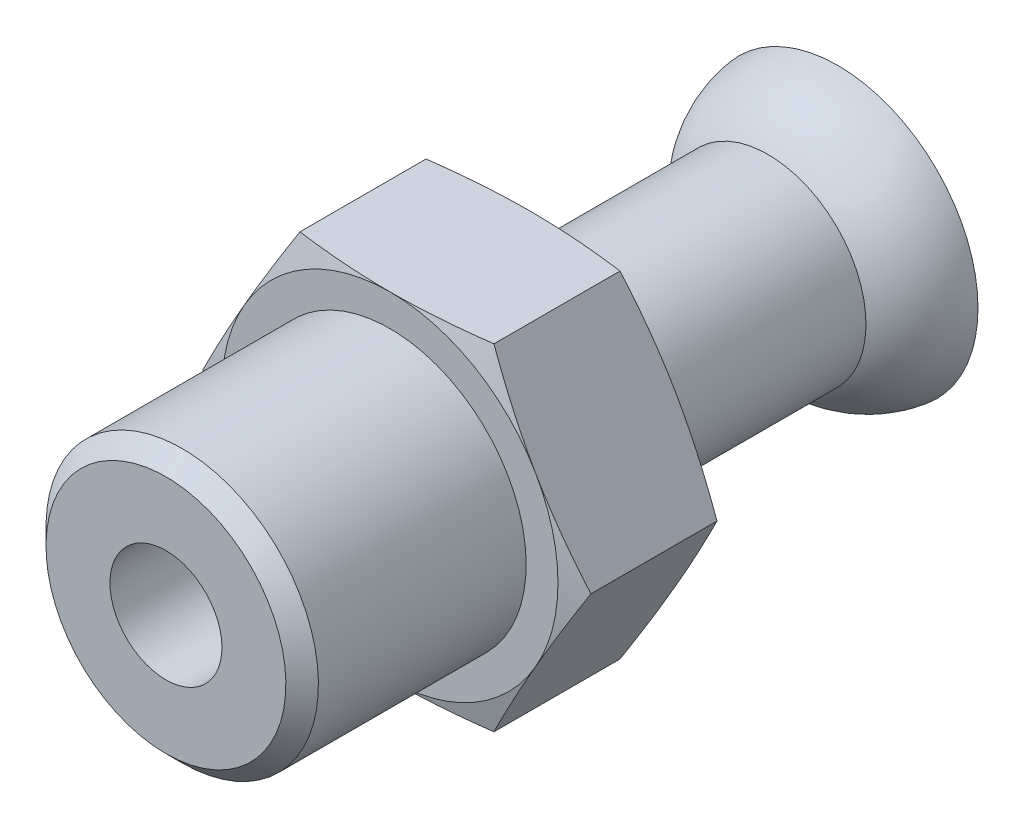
ISO-10303-21;
HEADER;
FILE_DESCRIPTION(('STEP AP214'),'2;1');
FILE_NAME('part.step','',(''),(''),'','','');
FILE_SCHEMA(('AUTOMOTIVE_DESIGN { 1 0 10303 214 1 1 1 1 }'));
ENDSEC;
DATA;
#1=APPLICATION_CONTEXT('core data for automotive mechanical design processes');
#2=APPLICATION_PROTOCOL_DEFINITION('international standard','automotive_design',2000,#1);
#3=PRODUCT_CONTEXT('',#1,'mechanical');
#4=PRODUCT('Part','Part','',(#3));
#5=PRODUCT_RELATED_PRODUCT_CATEGORY('part','',(#4));
#6=PRODUCT_DEFINITION_FORMATION('','',#4);
#7=PRODUCT_DEFINITION_CONTEXT('part definition',#1,'design');
#8=PRODUCT_DEFINITION('design','',#6,#7);
#9=PRODUCT_DEFINITION_SHAPE('','',#8);
#10=(LENGTH_UNIT() NAMED_UNIT(*) SI_UNIT(.MILLI.,.METRE.));
#11=(NAMED_UNIT(*) PLANE_ANGLE_UNIT() SI_UNIT($,.RADIAN.));
#12=(NAMED_UNIT(*) SI_UNIT($,.STERADIAN.) SOLID_ANGLE_UNIT());
#13=UNCERTAINTY_MEASURE_WITH_UNIT(LENGTH_MEASURE(1.E-05),#10,'distance_accuracy_value','');
#14=(GEOMETRIC_REPRESENTATION_CONTEXT(3) GLOBAL_UNCERTAINTY_ASSIGNED_CONTEXT((#13)) GLOBAL_UNIT_ASSIGNED_CONTEXT((#10,
#11,#12)) REPRESENTATION_CONTEXT('',''));
#15=CARTESIAN_POINT('',(0.,0.,0.));
#16=DIRECTION('',(0.,0.,1.));
#17=DIRECTION('',(1.,0.,0.));
#18=AXIS2_PLACEMENT_3D('',#15,#16,#17);
#19=CARTESIAN_POINT('',(6.92820323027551,0.,11.));
#20=DIRECTION('',(0.866025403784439,0.5,0.));
#21=DIRECTION('',(0.,0.,1.));
#22=AXIS2_PLACEMENT_3D('',#19,#20,#21);
#23=PLANE('',#22);
#24=DIRECTION('',(0.,0.,1.));
#25=VECTOR('',#24,1.);
#26=CARTESIAN_POINT('',(3.46410161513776,6.,11.));
#27=LINE('',#26,#25);
#28=CARTESIAN_POINT('',(3.46410161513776,6.,11.2487113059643));
#29=VERTEX_POINT('',#28);
#30=CARTESIAN_POINT('',(3.46410161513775,6.,15.7512886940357));
#31=VERTEX_POINT('',#30);
#32=EDGE_CURVE('E10',#29,#31,#27,.T.);
#33=ORIENTED_EDGE('',*,*,#32,.T.);
#34=CARTESIAN_POINT('',(5.19615242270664,3.00000000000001,16.));
#35=CARTESIAN_POINT('',(5.12404359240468,3.12480967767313,16.0000199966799));
#36=CARTESIAN_POINT('',(5.05188034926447,3.24958799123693,15.9986484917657));
#37=CARTESIAN_POINT('',(4.90798279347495,3.49847134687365,15.9931540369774));
#38=CARTESIAN_POINT('',(4.83624819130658,3.62257653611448,15.9890453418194));
#39=CARTESIAN_POINT('',(4.69263452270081,3.87142043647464,15.9780801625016));
#40=CARTESIAN_POINT('',(4.62075656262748,3.99615917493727,15.9712098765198));
#41=CARTESIAN_POINT('',(4.47601669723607,4.24735284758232,15.9547641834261));
#42=CARTESIAN_POINT('',(4.4031559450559,4.37380590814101,15.9451503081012));
#43=CARTESIAN_POINT('',(4.25929007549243,4.62306506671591,15.9237525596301));
#44=CARTESIAN_POINT('',(4.18828746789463,4.74587821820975,15.9120336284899));
#45=CARTESIAN_POINT('',(4.04576334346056,4.99249350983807,15.8862377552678));
#46=CARTESIAN_POINT('',(3.97424314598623,5.11629421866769,15.872139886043));
#47=CARTESIAN_POINT('',(3.83027325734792,5.36560571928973,15.8416075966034));
#48=CARTESIAN_POINT('',(3.75782595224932,5.49111391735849,15.8251409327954));
#49=CARTESIAN_POINT('',(3.61160134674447,5.74445673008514,15.7898805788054));
#50=CARTESIAN_POINT('',(3.5378266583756,5.87228726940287,15.7710466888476));
#51=CARTESIAN_POINT('',(3.46410161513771,5.99999999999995,15.7512886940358));
#52=B_SPLINE_CURVE_WITH_KNOTS('',3,(#34,#35,#36,#37,#38,#39,#40,#41,#42,#43,#44,#45,#46,#47,#48,
#49,#50,#51),.UNSPECIFIED.,.F.,.F.,(4,2,2,2,2,2,2,2,4),(0.,0.432421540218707,0.862608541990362,
1.29497279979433,1.73372521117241,2.16073850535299,2.59172526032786,3.02925966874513,
3.4756093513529),.UNSPECIFIED.);
#53=CARTESIAN_POINT('',(5.19615242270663,3.,16.));
#54=VERTEX_POINT('',#53);
#55=EDGE_CURVE('E752',#54,#31,#52,.T.);
#56=ORIENTED_EDGE('',*,*,#55,.F.);
#57=CARTESIAN_POINT('',(6.92820323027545,0.,15.7512886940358));
#58=CARTESIAN_POINT('',(6.85446990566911,0.127692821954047,15.7710449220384));
#59=CARTESIAN_POINT('',(6.78066033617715,0.255488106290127,15.7898769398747));
#60=CARTESIAN_POINT('',(6.63438238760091,0.508780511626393,15.825134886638));
#61=CARTESIAN_POINT('',(6.56191621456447,0.634273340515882,15.8416008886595));
#62=CARTESIAN_POINT('',(6.41799291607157,0.883612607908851,15.8721331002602));
#63=CARTESIAN_POINT('',(6.34653685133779,1.00745570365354,15.8862314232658));
#64=CARTESIAN_POINT('',(6.20421306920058,1.25420625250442,15.9120298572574));
#65=CARTESIAN_POINT('',(6.13334596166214,1.3771118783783,15.9237507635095));
#66=CARTESIAN_POINT('',(5.98940836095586,1.62632912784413,15.9451502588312));
#67=CARTESIAN_POINT('',(5.91633055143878,1.75264209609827,15.9547643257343));
#68=CARTESIAN_POINT('',(5.77116669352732,2.0035712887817,15.9712102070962));
#69=CARTESIAN_POINT('',(5.69908163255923,2.1281855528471,15.9780803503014));
#70=CARTESIAN_POINT('',(5.55538561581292,2.37698191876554,15.9890454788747));
#71=CARTESIAN_POINT('',(5.4837740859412,2.50116308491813,15.9931541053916));
#72=CARTESIAN_POINT('',(5.34017760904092,2.75023994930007,15.9986485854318));
#73=CARTESIAN_POINT('',(5.26819267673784,2.87513597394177,16.0000200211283));
#74=CARTESIAN_POINT('',(5.19615242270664,3.00000000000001,16.));
#75=B_SPLINE_CURVE_WITH_KNOTS('',3,(#57,#58,#59,#60,#61,#62,#63,#64,#65,#66,#67,#68,#69,#70,#71,
#72,#73,#74),.UNSPECIFIED.,.F.,.F.,(4,2,2,2,2,2,2,2,4),(0.,0.446310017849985,0.883832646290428,
1.31483340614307,1.74188406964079,2.180598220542,2.61294971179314,3.04314949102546,
3.47560937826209),.UNSPECIFIED.);
#76=CARTESIAN_POINT('',(6.92820323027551,0.,15.7512886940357));
#77=VERTEX_POINT('',#76);
#78=EDGE_CURVE('E816',#77,#54,#75,.T.);
#79=ORIENTED_EDGE('',*,*,#78,.F.);
#80=DIRECTION('',(0.,0.,1.));
#81=VECTOR('',#80,1.);
#82=CARTESIAN_POINT('',(6.92820323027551,0.,11.));
#83=LINE('',#82,#81);
#84=CARTESIAN_POINT('',(6.92820323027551,0.,11.2487113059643));
#85=VERTEX_POINT('',#84);
#86=EDGE_CURVE('E456',#85,#77,#83,.T.);
#87=ORIENTED_EDGE('',*,*,#86,.F.);
#88=CARTESIAN_POINT('',(5.19615242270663,3.,11.));
#89=CARTESIAN_POINT('',(5.26818635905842,2.8751470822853,10.9999800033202));
#90=CARTESIAN_POINT('',(5.34016592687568,2.75026272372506,11.0013515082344));
#91=CARTESIAN_POINT('',(5.48375645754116,2.50120210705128,11.0068459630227));
#92=CARTESIAN_POINT('',(5.55536740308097,2.37702552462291,11.0109546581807));
#93=CARTESIAN_POINT('',(5.6990657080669,2.12823048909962,11.0219198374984));
#94=CARTESIAN_POINT('',(5.77115364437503,2.00361298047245,11.0287901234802));
#95=CARTESIAN_POINT('',(5.91632381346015,1.75266774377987,11.0452358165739));
#96=CARTESIAN_POINT('',(5.98940500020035,1.62634195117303,11.0548496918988));
#97=CARTESIAN_POINT('',(6.13333682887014,1.37712087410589,11.0762474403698));
#98=CARTESIAN_POINT('',(6.20419483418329,1.25422423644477,11.0879663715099));
#99=CARTESIAN_POINT('',(6.34650787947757,1.00748707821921,11.1137622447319));
#100=CARTESIAN_POINT('',(6.4179623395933,0.883648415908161,11.1278601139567));
#101=CARTESIAN_POINT('',(6.56188748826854,0.634311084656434,11.1583924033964));
#102=CARTESIAN_POINT('',(6.63435712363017,0.508815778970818,11.1748590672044));
#103=CARTESIAN_POINT('',(6.78064613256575,0.2555101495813,11.2101194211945));
#104=CARTESIAN_POINT('',(6.85446328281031,0.127704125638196,11.2289533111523));
#105=CARTESIAN_POINT('',(6.92820323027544,0.,11.2487113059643));
#106=B_SPLINE_CURVE_WITH_KNOTS('',3,(#88,#89,#90,#91,#92,#93,#94,#95,#96,#97,#98,#99,#100,#101,
#102,#103,#104,#105),.UNSPECIFIED.,.F.,.F.,(4,2,2,2,2,2,2,2,4),(0.,0.432421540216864,
0.8626085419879,1.29497279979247,1.73372521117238,2.16073850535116,2.59172526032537,
3.02925966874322,3.4756093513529),.UNSPECIFIED.);
#107=CARTESIAN_POINT('',(5.19615242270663,3.,11.));
#108=VERTEX_POINT('',#107);
#109=EDGE_CURVE('E670',#108,#85,#106,.T.);
#110=ORIENTED_EDGE('',*,*,#109,.F.);
#111=CARTESIAN_POINT('',(3.46410161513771,5.99999999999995,11.2487113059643));
#112=CARTESIAN_POINT('',(3.53782018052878,5.8722986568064,11.2289550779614));
#113=CARTESIAN_POINT('',(3.61158935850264,5.74448005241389,11.2101230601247));
#114=CARTESIAN_POINT('',(3.75780804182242,5.49115343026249,11.174865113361));
#115=CARTESIAN_POINT('',(3.83025493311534,5.36564946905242,11.1583991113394));
#116=CARTESIAN_POINT('',(3.97422742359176,5.11633860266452,11.1278668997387));
#117=CARTESIAN_POINT('',(4.04575065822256,4.99253428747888,11.1137685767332));
#118=CARTESIAN_POINT('',(4.1882810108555,4.74590300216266,11.087970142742));
#119=CARTESIAN_POINT('',(4.25928685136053,4.62307747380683,11.0762492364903));
#120=CARTESIAN_POINT('',(4.40314652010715,4.37381523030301,11.0548497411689));
#121=CARTESIAN_POINT('',(4.47599785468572,4.24737150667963,11.0452356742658));
#122=CARTESIAN_POINT('',(4.6207269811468,3.99619132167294,11.0287897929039));
#123=CARTESIAN_POINT('',(4.69260356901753,3.87145669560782,11.0219196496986));
#124=CARTESIAN_POINT('',(4.83621953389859,3.62261411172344,11.0109545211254));
#125=CARTESIAN_POINT('',(4.90795781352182,3.49850612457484,11.0068458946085));
#126=CARTESIAN_POINT('',(5.05186646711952,3.24960949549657,11.0013514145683));
#127=CARTESIAN_POINT('',(5.1240371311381,3.12482070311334,10.9999799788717));
#128=CARTESIAN_POINT('',(5.19615242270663,3.,11.));
#129=B_SPLINE_CURVE_WITH_KNOTS('',3,(#111,#112,#113,#114,#115,#116,#117,#118,#119,#120,#121,
#122,#123,#124,#125,#126,#127,#128),.UNSPECIFIED.,.F.,.F.,(4,2,2,2,2,2,2,2,4),(0.,
0.446310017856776,0.883832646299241,1.31483340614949,1.74188406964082,2.18059822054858,
2.61294971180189,3.04314949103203,3.47560937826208),.UNSPECIFIED.);
#130=EDGE_CURVE('E603',#29,#108,#129,.T.);
#131=ORIENTED_EDGE('',*,*,#130,.F.);
#132=EDGE_LOOP('',(#33,#56,#79,#87,#110,#131));
#133=FACE_BOUND('',#132,.T.);
#134=ADVANCED_FACE('F15',(#133),#23,.T.);
#135=CARTESIAN_POINT('',(3.46410161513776,6.,11.));
#136=DIRECTION('',(0.,1.,0.));
#137=DIRECTION('',(-1.,0.,0.));
#138=AXIS2_PLACEMENT_3D('',#135,#136,#137);
#139=PLANE('',#138);
#140=DIRECTION('',(0.,0.,1.));
#141=VECTOR('',#140,1.);
#142=CARTESIAN_POINT('',(-3.46410161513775,6.,11.));
#143=LINE('',#142,#141);
#144=CARTESIAN_POINT('',(-3.46410161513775,6.,11.2487113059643));
#145=VERTEX_POINT('',#144);
#146=CARTESIAN_POINT('',(-3.46410161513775,6.,15.7512886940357));
#147=VERTEX_POINT('',#146);
#148=EDGE_CURVE('E29',#145,#147,#143,.T.);
#149=ORIENTED_EDGE('',*,*,#148,.T.);
#150=CARTESIAN_POINT('',(0.,6.00000000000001,16.));
#151=CARTESIAN_POINT('',(-0.144124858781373,5.99995669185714,16.0000200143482));
#152=CARTESIAN_POINT('',(-0.288249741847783,5.99985529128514,15.998647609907));
#153=CARTESIAN_POINT('',(-0.575724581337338,5.9996917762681,15.9931504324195));
#154=CARTESIAN_POINT('',(-0.719074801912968,5.99962946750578,15.9890394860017));
#155=CARTESIAN_POINT('',(-1.00641973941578,5.99969625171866,15.9780688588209));
#156=CARTESIAN_POINT('',(-1.15041390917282,5.99982634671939,15.9711949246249));
#157=CARTESIAN_POINT('',(-1.44040510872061,6.00008659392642,15.9547411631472));
#158=CARTESIAN_POINT('',(-1.58639991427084,6.00021671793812,15.9451224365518));
#159=CARTESIAN_POINT('',(-1.87425873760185,6.00025188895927,15.9237187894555));
#160=CARTESIAN_POINT('',(-2.0161276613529,6.00016292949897,15.9119995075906));
#161=CARTESIAN_POINT('',(-2.30096544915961,6.00002759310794,15.8862047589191));
#162=CARTESIAN_POINT('',(-2.44393243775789,5.99998161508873,15.872108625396));
#163=CARTESIAN_POINT('',(-2.73179478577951,5.99993999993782,15.8415817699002));
#164=CARTESIAN_POINT('',(-2.87668673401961,5.99994513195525,15.8251190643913));
#165=CARTESIAN_POINT('',(-3.16913182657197,5.99997062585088,15.7898686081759));
#166=CARTESIAN_POINT('',(-3.3166801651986,5.99999129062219,15.771040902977));
#167=CARTESIAN_POINT('',(-3.46410161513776,6.00000000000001,15.7512886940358));
#168=B_SPLINE_CURVE_WITH_KNOTS('',3,(#150,#151,#152,#153,#154,#155,#156,#157,#158,#159,#160,
#161,#162,#163,#164,#165,#166,#167),.UNSPECIFIED.,.F.,.F.,(4,2,2,2,2,2,2,2,4),(0.,
0.432367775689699,0.86256894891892,1.2950184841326,1.73393012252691,2.16096837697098,
2.59193173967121,3.02939030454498,3.47560819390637),.UNSPECIFIED.);
#169=CARTESIAN_POINT('',(0.,6.,16.));
#170=VERTEX_POINT('',#169);
#171=EDGE_CURVE('E509',#170,#147,#168,.T.);
#172=ORIENTED_EDGE('',*,*,#171,.F.);
#173=CARTESIAN_POINT('',(3.46410161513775,6.00000000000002,15.7512886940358));
#174=CARTESIAN_POINT('',(3.31726869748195,5.99999159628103,15.7709619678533));
#175=CARTESIAN_POINT('',(3.17031004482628,5.99996749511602,15.7897190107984));
#176=CARTESIAN_POINT('',(2.87903739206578,5.99993021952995,15.8248474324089));
#177=CARTESIAN_POINT('',(2.73472816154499,5.9999168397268,15.8412584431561));
#178=CARTESIAN_POINT('',(2.4480336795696,5.99993958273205,15.8717010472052));
#179=CARTESIAN_POINT('',(2.30565182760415,5.99997497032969,15.8857644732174));
#180=CARTESIAN_POINT('',(2.02199764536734,6.00008886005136,15.9115131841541));
#181=CARTESIAN_POINT('',(1.88072720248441,6.00016696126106,15.9232192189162));
#182=CARTESIAN_POINT('',(1.59291852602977,6.00012156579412,15.9447025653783));
#183=CARTESIAN_POINT('',(1.44637393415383,5.99999070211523,15.9543951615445));
#184=CARTESIAN_POINT('',(1.15526705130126,5.99974077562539,15.9709752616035));
#185=CARTESIAN_POINT('',(1.01070698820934,5.99962156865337,15.9779015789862));
#186=CARTESIAN_POINT('',(0.72219940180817,5.99958067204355,15.9889562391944));
#187=CARTESIAN_POINT('',(0.578252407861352,5.99965800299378,15.9930983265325));
#188=CARTESIAN_POINT('',(0.289537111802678,5.99984558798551,15.9986377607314));
#189=CARTESIAN_POINT('',(0.14476852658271,5.9999560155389,16.0000203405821));
#190=CARTESIAN_POINT('',(0.,6.00000000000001,16.));
#191=B_SPLINE_CURVE_WITH_KNOTS('',3,(#173,#174,#175,#176,#177,#178,#179,#180,#181,#182,#183,
#184,#185,#186,#187,#188,#189,#190),.UNSPECIFIED.,.F.,.F.,(4,2,2,2,2,2,2,2,4),(0.,
0.444436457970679,0.880140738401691,1.30934776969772,1.73459368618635,2.17516540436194,
2.60931783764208,3.04131099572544,3.47560975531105),.UNSPECIFIED.);
#192=EDGE_CURVE('E722',#31,#170,#191,.T.);
#193=ORIENTED_EDGE('',*,*,#192,.F.);
#194=ORIENTED_EDGE('',*,*,#32,.F.);
#195=CARTESIAN_POINT('',(0.,6.,11.));
#196=CARTESIAN_POINT('',(0.144124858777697,5.99995669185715,10.9999799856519));
#197=CARTESIAN_POINT('',(0.288249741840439,5.9998552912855,11.001352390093));
#198=CARTESIAN_POINT('',(0.575724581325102,5.99969177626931,11.0068495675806));
#199=CARTESIAN_POINT('',(0.719074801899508,5.9996294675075,11.0109605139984));
#200=CARTESIAN_POINT('',(1.00641973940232,5.99969625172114,11.0219311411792));
#201=CARTESIAN_POINT('',(1.15041390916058,5.99982634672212,11.0288050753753));
#202=CARTESIAN_POINT('',(1.44040510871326,6.00008659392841,11.0452588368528));
#203=CARTESIAN_POINT('',(1.58639991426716,6.00021671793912,11.0548775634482));
#204=CARTESIAN_POINT('',(1.8742587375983,6.00025188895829,11.076281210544));
#205=CARTESIAN_POINT('',(2.01612766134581,6.00016292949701,11.0880004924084));
#206=CARTESIAN_POINT('',(2.30096544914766,6.00002759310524,11.1137952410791));
#207=CARTESIAN_POINT('',(2.4439324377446,5.99998161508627,11.1278913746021));
#208=CARTESIAN_POINT('',(2.73179478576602,5.99993999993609,11.1584182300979));
#209=CARTESIAN_POINT('',(2.87668673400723,5.99994513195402,11.174880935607));
#210=CARTESIAN_POINT('',(3.16913182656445,5.9999706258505,11.2101313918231));
#211=CARTESIAN_POINT('',(3.31668016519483,5.99999129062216,11.2289590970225));
#212=CARTESIAN_POINT('',(3.46410161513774,6.00000000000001,11.2487113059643));
#213=B_SPLINE_CURVE_WITH_KNOTS('',3,(#195,#196,#197,#198,#199,#200,#201,#202,#203,#204,#205,
#206,#207,#208,#209,#210,#211,#212),.UNSPECIFIED.,.F.,.F.,(4,2,2,2,2,2,2,2,4),(0.,
0.4323677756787,0.862568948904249,1.2950184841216,1.73393012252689,2.16096837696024,
2.59193173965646,3.02939030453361,3.47560819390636),.UNSPECIFIED.);
#214=CARTESIAN_POINT('',(0.,6.,11.));
#215=VERTEX_POINT('',#214);
#216=EDGE_CURVE('E614',#215,#29,#213,.T.);
#217=ORIENTED_EDGE('',*,*,#216,.F.);
#218=CARTESIAN_POINT('',(-3.46410161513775,6.00000000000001,11.2487113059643));
#219=CARTESIAN_POINT('',(-3.31726869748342,5.99999159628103,11.2290380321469));
#220=CARTESIAN_POINT('',(-3.17031004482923,5.99996749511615,11.2102809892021));
#221=CARTESIAN_POINT('',(-2.87903739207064,5.99993021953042,11.1751525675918));
#222=CARTESIAN_POINT('',(-2.73472816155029,5.99991683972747,11.1587415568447));
#223=CARTESIAN_POINT('',(-2.4480336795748,5.999939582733,11.1282989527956));
#224=CARTESIAN_POINT('',(-2.30565182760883,5.99997497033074,11.1142355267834));
#225=CARTESIAN_POINT('',(-2.02199764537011,6.00008886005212,11.0884868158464));
#226=CARTESIAN_POINT('',(-1.88072720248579,6.00016696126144,11.076780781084));
#227=CARTESIAN_POINT('',(-1.5929185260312,6.00012156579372,11.0552974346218));
#228=CARTESIAN_POINT('',(-1.44637393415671,5.99999070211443,11.0456048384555));
#229=CARTESIAN_POINT('',(-1.15526705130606,5.9997407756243,11.0290247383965));
#230=CARTESIAN_POINT('',(-1.01070698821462,5.99962156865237,11.0220984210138));
#231=CARTESIAN_POINT('',(-0.722199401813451,5.99958067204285,11.0110437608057));
#232=CARTESIAN_POINT('',(-0.578252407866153,5.99965800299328,11.0069016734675));
#233=CARTESIAN_POINT('',(-0.289537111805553,5.99984558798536,11.0013622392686));
#234=CARTESIAN_POINT('',(-0.14476852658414,5.99995601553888,10.9999796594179));
#235=CARTESIAN_POINT('',(0.,6.,11.));
#236=B_SPLINE_CURVE_WITH_KNOTS('',3,(#218,#219,#220,#221,#222,#223,#224,#225,#226,#227,#228,
#229,#230,#231,#232,#233,#234,#235),.UNSPECIFIED.,.F.,.F.,(4,2,2,2,2,2,2,2,4),(0.,
0.444436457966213,0.880140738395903,1.30934776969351,1.73459368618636,2.17516540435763,
2.60931783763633,3.04131099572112,3.47560975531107),.UNSPECIFIED.);
#237=EDGE_CURVE('E169',#145,#215,#236,.T.);
#238=ORIENTED_EDGE('',*,*,#237,.F.);
#239=EDGE_LOOP('',(#149,#172,#193,#194,#217,#238));
#240=FACE_BOUND('',#239,.T.);
#241=ADVANCED_FACE('F219',(#240),#139,.T.);
#242=CARTESIAN_POINT('',(-3.46410161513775,6.,11.));
#243=DIRECTION('',(-0.866025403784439,0.5,0.));
#244=DIRECTION('',(0.,0.,-1.));
#245=AXIS2_PLACEMENT_3D('',#242,#243,#244);
#246=PLANE('',#245);
#247=DIRECTION('',(0.,0.,1.));
#248=VECTOR('',#247,1.);
#249=CARTESIAN_POINT('',(-6.92820323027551,0.,11.));
#250=LINE('',#249,#248);
#251=CARTESIAN_POINT('',(-6.92820323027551,0.,11.2487113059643));
#252=VERTEX_POINT('',#251);
#253=CARTESIAN_POINT('',(-6.92820323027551,0.,15.7512886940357));
#254=VERTEX_POINT('',#253);
#255=EDGE_CURVE('E277',#252,#254,#250,.T.);
#256=ORIENTED_EDGE('',*,*,#255,.T.);
#257=CARTESIAN_POINT('',(-5.19615242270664,3.,16.));
#258=CARTESIAN_POINT('',(-5.26818635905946,2.87514708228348,16.0000199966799));
#259=CARTESIAN_POINT('',(-5.34016592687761,2.75026272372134,15.9986484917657));
#260=CARTESIAN_POINT('',(-5.48375645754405,2.5012021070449,15.9931540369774));
#261=CARTESIAN_POINT('',(-5.55536740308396,2.37702552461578,15.9890453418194));
#262=CARTESIAN_POINT('',(-5.69906570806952,2.12823048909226,15.9780801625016));
#263=CARTESIAN_POINT('',(-5.77115364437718,2.00361298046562,15.9712098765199));
#264=CARTESIAN_POINT('',(-5.91632381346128,1.75266774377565,15.9547641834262));
#265=CARTESIAN_POINT('',(-5.98940500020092,1.62634195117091,15.9451503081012));
#266=CARTESIAN_POINT('',(-6.13333682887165,1.37712087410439,15.9237525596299));
#267=CARTESIAN_POINT('',(-6.20419483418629,1.25422423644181,15.9120336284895));
#268=CARTESIAN_POINT('',(-6.34650787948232,1.00748707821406,15.8862377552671));
#269=CARTESIAN_POINT('',(-6.41796233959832,0.883648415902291,15.8721398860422));
#270=CARTESIAN_POINT('',(-6.56188748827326,0.634311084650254,15.8416075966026));
#271=CARTESIAN_POINT('',(-6.63435712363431,0.508815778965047,15.8251409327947));
#272=CARTESIAN_POINT('',(-6.78064613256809,0.255510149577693,15.789880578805));
#273=CARTESIAN_POINT('',(-6.85446328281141,0.127704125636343,15.7710466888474));
#274=CARTESIAN_POINT('',(-6.92820323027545,0.,15.7512886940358));
#275=B_SPLINE_CURVE_WITH_KNOTS('',3,(#257,#258,#259,#260,#261,#262,#263,#264,#265,#266,#267,
#268,#269,#270,#271,#272,#273,#274),.UNSPECIFIED.,.F.,.F.,(4,2,2,2,2,2,2,2,4),(0.,
0.432421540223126,0.862608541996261,1.29497279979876,1.73372521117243,2.16073850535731,
2.5917252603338,3.02925966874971,3.47560935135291),.UNSPECIFIED.);
#276=CARTESIAN_POINT('',(-5.19615242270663,3.,16.));
#277=VERTEX_POINT('',#276);
#278=EDGE_CURVE('E538',#277,#254,#275,.T.);
#279=ORIENTED_EDGE('',*,*,#278,.F.);
#280=CARTESIAN_POINT('',(-3.46410161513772,5.99999999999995,15.7512886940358));
#281=CARTESIAN_POINT('',(-3.53782018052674,5.87229865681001,15.7710449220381));
#282=CARTESIAN_POINT('',(-3.61158935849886,5.74448005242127,15.7898769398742));
#283=CARTESIAN_POINT('',(-3.75780804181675,5.491153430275,15.8251348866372));
#284=CARTESIAN_POINT('',(-3.83025493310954,5.36564946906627,15.8416008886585));
#285=CARTESIAN_POINT('',(-3.97422742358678,5.11633860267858,15.8721331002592));
#286=CARTESIAN_POINT('',(-4.04575065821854,4.9925342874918,15.8862314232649));
#287=CARTESIAN_POINT('',(-4.18828101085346,4.74590300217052,15.9120298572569));
#288=CARTESIAN_POINT('',(-4.25928685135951,4.62307747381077,15.9237507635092));
#289=CARTESIAN_POINT('',(-4.40314652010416,4.37381523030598,15.9451502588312));
#290=CARTESIAN_POINT('',(-4.47599785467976,4.24737150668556,15.9547643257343));
#291=CARTESIAN_POINT('',(-4.62072698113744,3.99619132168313,15.9712102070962));
#292=CARTESIAN_POINT('',(-4.69260356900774,3.87145669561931,15.9780803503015));
#293=CARTESIAN_POINT('',(-4.83621953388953,3.62261411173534,15.9890454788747));
#294=CARTESIAN_POINT('',(-4.90795781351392,3.49850612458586,15.9931541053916));
#295=CARTESIAN_POINT('',(-5.05186646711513,3.24960949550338,15.9986485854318));
#296=CARTESIAN_POINT('',(-5.12403713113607,3.12482070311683,16.0000200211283));
#297=CARTESIAN_POINT('',(-5.19615242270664,3.,16.));
#298=B_SPLINE_CURVE_WITH_KNOTS('',3,(#280,#281,#282,#283,#284,#285,#286,#287,#288,#289,#290,
#291,#292,#293,#294,#295,#296,#297),.UNSPECIFIED.,.F.,.F.,(4,2,2,2,2,2,2,2,4),(0.,
0.446310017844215,0.883832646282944,1.31483340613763,1.74188406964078,2.18059822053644,
2.61294971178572,3.0431494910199,3.47560937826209),.UNSPECIFIED.);
#299=EDGE_CURVE('E536',#147,#277,#298,.T.);
#300=ORIENTED_EDGE('',*,*,#299,.F.);
#301=ORIENTED_EDGE('',*,*,#148,.F.);
#302=CARTESIAN_POINT('',(-5.19615242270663,3.,11.));
#303=CARTESIAN_POINT('',(-5.12404359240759,3.12480967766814,10.9999800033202));
#304=CARTESIAN_POINT('',(-5.05188034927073,3.24958799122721,11.0013515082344));
#305=CARTESIAN_POINT('',(-4.90798279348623,3.49847134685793,11.0068459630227));
#306=CARTESIAN_POINT('',(-4.83624819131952,3.62257653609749,11.0109546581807));
#307=CARTESIAN_POINT('',(-4.69263452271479,3.87142043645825,11.0219198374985));
#308=CARTESIAN_POINT('',(-4.62075656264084,3.99615917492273,11.0287901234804));
#309=CARTESIAN_POINT('',(-4.47601669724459,4.24735284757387,11.045235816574));
#310=CARTESIAN_POINT('',(-4.40315594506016,4.37380590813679,11.0548496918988));
#311=CARTESIAN_POINT('',(-4.25929007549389,4.62306506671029,11.0762474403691));
#312=CARTESIAN_POINT('',(-4.18828746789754,4.74587821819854,11.0879663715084));
#313=CARTESIAN_POINT('',(-4.04576334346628,4.99249350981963,11.1137622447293));
#314=CARTESIAN_POINT('',(-3.97424314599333,5.11629421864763,11.127860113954));
#315=CARTESIAN_POINT('',(-3.83027325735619,5.36560571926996,11.1583924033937));
#316=CARTESIAN_POINT('',(-3.7578259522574,5.49111391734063,11.1748590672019));
#317=CARTESIAN_POINT('',(-3.61160134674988,5.74445673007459,11.210119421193));
#318=CARTESIAN_POINT('',(-3.53782665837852,5.87228726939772,11.2289533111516));
#319=CARTESIAN_POINT('',(-3.46410161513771,5.99999999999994,11.2487113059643));
#320=B_SPLINE_CURVE_WITH_KNOTS('',3,(#302,#303,#304,#305,#306,#307,#308,#309,#310,#311,#312,
#313,#314,#315,#316,#317,#318,#319),.UNSPECIFIED.,.F.,.F.,(4,2,2,2,2,2,2,2,4),(0.,
0.432421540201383,0.862608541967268,1.294972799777,1.73372521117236,2.16073850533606,
2.59172526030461,3.0292596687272,3.47560935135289),.UNSPECIFIED.);
#321=CARTESIAN_POINT('',(-5.19615242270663,3.,11.));
#322=VERTEX_POINT('',#321);
#323=EDGE_CURVE('E154',#322,#145,#320,.T.);
#324=ORIENTED_EDGE('',*,*,#323,.F.);
#325=CARTESIAN_POINT('',(-6.92820323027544,0.,11.2487113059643));
#326=CARTESIAN_POINT('',(-6.85446990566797,0.127692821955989,11.2289550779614));
#327=CARTESIAN_POINT('',(-6.78066033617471,0.255488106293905,11.2101230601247));
#328=CARTESIAN_POINT('',(-6.63438238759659,0.508780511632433,11.174865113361));
#329=CARTESIAN_POINT('',(-6.56191621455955,0.634273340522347,11.1583991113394));
#330=CARTESIAN_POINT('',(-6.41799291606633,0.883612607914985,11.1278668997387));
#331=CARTESIAN_POINT('',(-6.34653685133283,1.00745570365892,11.1137685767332));
#332=CARTESIAN_POINT('',(-6.20421306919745,1.2542062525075,11.087970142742));
#333=CARTESIAN_POINT('',(-6.13334596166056,1.37711187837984,11.0762492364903));
#334=CARTESIAN_POINT('',(-5.98940836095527,1.62632912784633,11.0548497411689));
#335=CARTESIAN_POINT('',(-5.91633055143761,1.75264209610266,11.0452356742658));
#336=CARTESIAN_POINT('',(-5.77116669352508,2.00357128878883,11.0287897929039));
#337=CARTESIAN_POINT('',(-5.6990816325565,2.12818555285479,11.0219196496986));
#338=CARTESIAN_POINT('',(-5.5553856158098,2.37698191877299,11.0109545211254));
#339=CARTESIAN_POINT('',(-5.48377408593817,2.50116308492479,11.0068458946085));
#340=CARTESIAN_POINT('',(-5.34017760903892,2.75023994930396,11.0013514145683));
#341=CARTESIAN_POINT('',(-5.26819267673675,2.87513597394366,10.9999799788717));
#342=CARTESIAN_POINT('',(-5.19615242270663,3.,11.));
#343=B_SPLINE_CURVE_WITH_KNOTS('',3,(#325,#326,#327,#328,#329,#330,#331,#332,#333,#334,#335,
#336,#337,#338,#339,#340,#341,#342),.UNSPECIFIED.,.F.,.F.,(4,2,2,2,2,2,2,2,4),(0.,
0.446310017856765,0.883832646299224,1.31483340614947,1.7418840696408,2.18059822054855,
2.61294971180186,3.043149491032,3.47560937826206),.UNSPECIFIED.);
#344=EDGE_CURVE('E160',#252,#322,#343,.T.);
#345=ORIENTED_EDGE('',*,*,#344,.F.);
#346=EDGE_LOOP('',(#256,#279,#300,#301,#324,#345));
#347=FACE_BOUND('',#346,.T.);
#348=ADVANCED_FACE('F158',(#347),#246,.T.);
#349=CARTESIAN_POINT('',(-6.92820323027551,0.,11.));
#350=DIRECTION('',(-0.866025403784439,-0.5,0.));
#351=DIRECTION('',(0.,0.,-1.));
#352=AXIS2_PLACEMENT_3D('',#349,#350,#351);
#353=PLANE('',#352);
#354=DIRECTION('',(0.,0.,1.));
#355=VECTOR('',#354,1.);
#356=CARTESIAN_POINT('',(-3.46410161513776,-6.,11.));
#357=LINE('',#356,#355);
#358=CARTESIAN_POINT('',(-3.46410161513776,-6.,11.2487113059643));
#359=VERTEX_POINT('',#358);
#360=CARTESIAN_POINT('',(-3.46410161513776,-6.,15.7512886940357));
#361=VERTEX_POINT('',#360);
#362=EDGE_CURVE('E269',#359,#361,#357,.T.);
#363=ORIENTED_EDGE('',*,*,#362,.T.);
#364=CARTESIAN_POINT('',(-5.19615242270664,-3.,16.));
#365=CARTESIAN_POINT('',(-5.12404359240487,-3.12480967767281,16.0000199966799));
#366=CARTESIAN_POINT('',(-5.05188034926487,-3.24958799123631,15.9986484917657));
#367=CARTESIAN_POINT('',(-4.90798279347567,-3.49847134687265,15.9931540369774));
#368=CARTESIAN_POINT('',(-4.8362481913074,-3.6225765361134,15.9890453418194));
#369=CARTESIAN_POINT('',(-4.69263452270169,-3.8714204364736,15.9780801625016));
#370=CARTESIAN_POINT('',(-4.62075656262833,-3.99615917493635,15.9712098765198));
#371=CARTESIAN_POINT('',(-4.47601669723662,-4.24735284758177,15.9547641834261));
#372=CARTESIAN_POINT('',(-4.40315594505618,-4.37380590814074,15.9451503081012));
#373=CARTESIAN_POINT('',(-4.25929007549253,-4.62306506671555,15.9237525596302));
#374=CARTESIAN_POINT('',(-4.18828746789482,-4.74587821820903,15.91203362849));
#375=CARTESIAN_POINT('',(-4.04576334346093,-4.9924935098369,15.886237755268));
#376=CARTESIAN_POINT('',(-3.97424314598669,-5.11629421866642,15.8721398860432));
#377=CARTESIAN_POINT('',(-3.83027325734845,-5.36560571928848,15.8416075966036));
#378=CARTESIAN_POINT('',(-3.75782595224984,-5.49111391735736,15.8251409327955));
#379=CARTESIAN_POINT('',(-3.61160134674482,-5.74445673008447,15.7898805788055));
#380=CARTESIAN_POINT('',(-3.5378266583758,-5.87228726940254,15.7710466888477));
#381=CARTESIAN_POINT('',(-3.46410161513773,-5.99999999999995,15.7512886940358));
#382=B_SPLINE_CURVE_WITH_KNOTS('',3,(#364,#365,#366,#367,#368,#369,#370,#371,#372,#373,#374,
#375,#376,#377,#378,#379,#380,#381),.UNSPECIFIED.,.F.,.F.,(4,2,2,2,2,2,2,2,4),(0.,
0.432421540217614,0.862608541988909,1.29497279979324,1.73372521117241,2.16073850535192,
2.5917252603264,3.02925966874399,3.47560935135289),.UNSPECIFIED.);
#383=CARTESIAN_POINT('',(-5.19615242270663,-3.,16.));
#384=VERTEX_POINT('',#383);
#385=EDGE_CURVE('E283',#384,#361,#382,.T.);
#386=ORIENTED_EDGE('',*,*,#385,.F.);
#387=CARTESIAN_POINT('',(-6.92820323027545,0.,15.7512886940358));
#388=CARTESIAN_POINT('',(-6.85446990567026,-0.127692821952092,15.7710449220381));
#389=CARTESIAN_POINT('',(-6.78066033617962,-0.255488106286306,15.7898769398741));
#390=CARTESIAN_POINT('',(-6.6343823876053,-0.508780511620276,15.825134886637));
#391=CARTESIAN_POINT('',(-6.56191621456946,-0.634273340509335,15.8416008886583));
#392=CARTESIAN_POINT('',(-6.41799291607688,-0.883612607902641,15.872133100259));
#393=CARTESIAN_POINT('',(-6.34653685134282,-1.0074557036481,15.8862314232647));
#394=CARTESIAN_POINT('',(-6.20421306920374,-1.25420625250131,15.9120298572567));
#395=CARTESIAN_POINT('',(-6.13334596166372,-1.37711187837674,15.9237507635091));
#396=CARTESIAN_POINT('',(-5.98940836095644,-1.62632912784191,15.9451502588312));
#397=CARTESIAN_POINT('',(-5.91633055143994,-1.75264209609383,15.9547643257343));
#398=CARTESIAN_POINT('',(-5.77116669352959,-2.00357128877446,15.9712102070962));
#399=CARTESIAN_POINT('',(-5.699081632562,-2.1281855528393,15.9780803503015));
#400=CARTESIAN_POINT('',(-5.55538561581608,-2.37698191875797,15.9890454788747));
#401=CARTESIAN_POINT('',(-5.48377408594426,-2.50116308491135,15.9931541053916));
#402=CARTESIAN_POINT('',(-5.34017760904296,-2.75023994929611,15.9986485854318));
#403=CARTESIAN_POINT('',(-5.26819267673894,-2.87513597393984,16.0000200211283));
#404=CARTESIAN_POINT('',(-5.19615242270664,-3.,16.));
#405=B_SPLINE_CURVE_WITH_KNOTS('',3,(#387,#388,#389,#390,#391,#392,#393,#394,#395,#396,#397,
#398,#399,#400,#401,#402,#403,#404),.UNSPECIFIED.,.F.,.F.,(4,2,2,2,2,2,2,2,4),(0.,
0.446310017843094,0.883832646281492,1.31483340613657,1.74188406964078,2.18059822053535,
2.61294971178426,3.0431494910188,3.47560937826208),.UNSPECIFIED.);
#406=EDGE_CURVE('E552',#254,#384,#405,.T.);
#407=ORIENTED_EDGE('',*,*,#406,.F.);
#408=ORIENTED_EDGE('',*,*,#255,.F.);
#409=CARTESIAN_POINT('',(-5.19615242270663,-3.,11.));
#410=CARTESIAN_POINT('',(-5.26818635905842,-2.87514708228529,10.9999800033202));
#411=CARTESIAN_POINT('',(-5.34016592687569,-2.75026272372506,11.0013515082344));
#412=CARTESIAN_POINT('',(-5.48375645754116,-2.50120210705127,11.0068459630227));
#413=CARTESIAN_POINT('',(-5.55536740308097,-2.37702552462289,11.0109546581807));
#414=CARTESIAN_POINT('',(-5.6990657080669,-2.1282304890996,11.0219198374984));
#415=CARTESIAN_POINT('',(-5.77115364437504,-2.00361298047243,11.0287901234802));
#416=CARTESIAN_POINT('',(-5.91632381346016,-1.75266774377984,11.0452358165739));
#417=CARTESIAN_POINT('',(-5.98940500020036,-1.626341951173,11.0548496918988));
#418=CARTESIAN_POINT('',(-6.13333682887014,-1.37712087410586,11.0762474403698));
#419=CARTESIAN_POINT('',(-6.20419483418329,-1.25422423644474,11.0879663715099));
#420=CARTESIAN_POINT('',(-6.34650787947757,-1.00748707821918,11.1137622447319));
#421=CARTESIAN_POINT('',(-6.4179623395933,-0.883648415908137,11.1278601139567));
#422=CARTESIAN_POINT('',(-6.56188748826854,-0.634311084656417,11.1583924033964));
#423=CARTESIAN_POINT('',(-6.63435712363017,-0.508815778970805,11.1748590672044));
#424=CARTESIAN_POINT('',(-6.78064613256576,-0.255510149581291,11.2101194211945));
#425=CARTESIAN_POINT('',(-6.85446328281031,-0.127704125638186,11.2289533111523));
#426=CARTESIAN_POINT('',(-6.92820323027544,0.,11.2487113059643));
#427=B_SPLINE_CURVE_WITH_KNOTS('',3,(#409,#410,#411,#412,#413,#414,#415,#416,#417,#418,#419,
#420,#421,#422,#423,#424,#425,#426),.UNSPECIFIED.,.F.,.F.,(4,2,2,2,2,2,2,2,4),(0.,
0.432421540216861,0.862608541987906,1.29497279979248,1.73372521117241,2.16073850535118,
2.59172526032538,3.02925966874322,3.4756093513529),.UNSPECIFIED.);
#428=CARTESIAN_POINT('',(-5.19615242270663,-3.,11.));
#429=VERTEX_POINT('',#428);
#430=EDGE_CURVE('E187',#429,#252,#427,.T.);
#431=ORIENTED_EDGE('',*,*,#430,.F.);
#432=CARTESIAN_POINT('',(-3.46410161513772,-5.99999999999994,11.2487113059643));
#433=CARTESIAN_POINT('',(-3.53782018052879,-5.8722986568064,11.2289550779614));
#434=CARTESIAN_POINT('',(-3.61158935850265,-5.74448005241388,11.2101230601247));
#435=CARTESIAN_POINT('',(-3.75780804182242,-5.49115343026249,11.174865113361));
#436=CARTESIAN_POINT('',(-3.83025493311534,-5.36564946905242,11.1583991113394));
#437=CARTESIAN_POINT('',(-3.97422742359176,-5.11633860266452,11.1278668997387));
#438=CARTESIAN_POINT('',(-4.04575065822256,-4.99253428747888,11.1137685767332));
#439=CARTESIAN_POINT('',(-4.1882810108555,-4.74590300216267,11.087970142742));
#440=CARTESIAN_POINT('',(-4.25928685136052,-4.62307747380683,11.0762492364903));
#441=CARTESIAN_POINT('',(-4.40314652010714,-4.37381523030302,11.0548497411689));
#442=CARTESIAN_POINT('',(-4.47599785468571,-4.24737150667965,11.0452356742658));
#443=CARTESIAN_POINT('',(-4.62072698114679,-3.99619132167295,11.0287897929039));
#444=CARTESIAN_POINT('',(-4.69260356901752,-3.87145669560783,11.0219196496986));
#445=CARTESIAN_POINT('',(-4.83621953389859,-3.62261411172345,11.0109545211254));
#446=CARTESIAN_POINT('',(-4.90795781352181,-3.49850612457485,11.0068458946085));
#447=CARTESIAN_POINT('',(-5.05186646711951,-3.24960949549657,11.0013514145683));
#448=CARTESIAN_POINT('',(-5.1240371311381,-3.12482070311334,10.9999799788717));
#449=CARTESIAN_POINT('',(-5.19615242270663,-3.,11.));
#450=B_SPLINE_CURVE_WITH_KNOTS('',3,(#432,#433,#434,#435,#436,#437,#438,#439,#440,#441,#442,
#443,#444,#445,#446,#447,#448,#449),.UNSPECIFIED.,.F.,.F.,(4,2,2,2,2,2,2,2,4),(0.,
0.446310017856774,0.883832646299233,1.31483340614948,1.7418840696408,2.18059822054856,
2.61294971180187,3.04314949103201,3.47560937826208),.UNSPECIFIED.);
#451=EDGE_CURVE('E197',#359,#429,#450,.T.);
#452=ORIENTED_EDGE('',*,*,#451,.F.);
#453=EDGE_LOOP('',(#363,#386,#407,#408,#431,#452));
#454=FACE_BOUND('',#453,.T.);
#455=ADVANCED_FACE('F218',(#454),#353,.T.);
#456=CARTESIAN_POINT('',(-3.46410161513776,-6.,11.));
#457=DIRECTION('',(0.,-1.,0.));
#458=DIRECTION('',(0.,0.,-1.));
#459=AXIS2_PLACEMENT_3D('',#456,#457,#458);
#460=PLANE('',#459);
#461=DIRECTION('',(0.,0.,1.));
#462=VECTOR('',#461,1.);
#463=CARTESIAN_POINT('',(3.46410161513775,-6.,11.));
#464=LINE('',#463,#462);
#465=CARTESIAN_POINT('',(3.46410161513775,-6.,11.2487113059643));
#466=VERTEX_POINT('',#465);
#467=CARTESIAN_POINT('',(3.46410161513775,-6.,15.7512886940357));
#468=VERTEX_POINT('',#467);
#469=EDGE_CURVE('E278',#466,#468,#464,.T.);
#470=ORIENTED_EDGE('',*,*,#469,.T.);
#471=CARTESIAN_POINT('',(0.,-6.00000000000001,16.));
#472=CARTESIAN_POINT('',(0.14412485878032,-5.99995669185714,16.0000200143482));
#473=CARTESIAN_POINT('',(0.288249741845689,-5.99985529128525,15.998647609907));
#474=CARTESIAN_POINT('',(0.575724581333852,-5.99969177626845,15.9931504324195));
#475=CARTESIAN_POINT('',(0.719074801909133,-5.99962946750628,15.9890394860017));
#476=CARTESIAN_POINT('',(1.00641973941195,-5.99969625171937,15.9780688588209));
#477=CARTESIAN_POINT('',(1.15041390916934,-5.99982634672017,15.9711949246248));
#478=CARTESIAN_POINT('',(1.44040510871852,-6.00008659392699,15.9547411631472));
#479=CARTESIAN_POINT('',(1.58639991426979,-6.00021671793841,15.9451224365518));
#480=CARTESIAN_POINT('',(1.87425873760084,-6.000251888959,15.9237187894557));
#481=CARTESIAN_POINT('',(2.01612766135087,-6.00016292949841,15.9119995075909));
#482=CARTESIAN_POINT('',(2.3009654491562,-6.00002759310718,15.8862047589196));
#483=CARTESIAN_POINT('',(2.44393243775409,-5.99998161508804,15.8721086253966));
#484=CARTESIAN_POINT('',(2.73179478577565,-5.99993999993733,15.8415817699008));
#485=CARTESIAN_POINT('',(2.87668673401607,-5.99994513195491,15.8251190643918));
#486=CARTESIAN_POINT('',(3.16913182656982,-5.99997062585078,15.7898686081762));
#487=CARTESIAN_POINT('',(3.31668016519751,-5.99999129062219,15.7710409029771));
#488=CARTESIAN_POINT('',(3.46410161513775,-6.00000000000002,15.7512886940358));
#489=B_SPLINE_CURVE_WITH_KNOTS('',3,(#471,#472,#473,#474,#475,#476,#477,#478,#479,#480,#481,
#482,#483,#484,#485,#486,#487,#488),.UNSPECIFIED.,.F.,.F.,(4,2,2,2,2,2,2,2,4),(0.,
0.432367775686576,0.862568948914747,1.29501848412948,1.73393012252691,2.16096837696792,
2.591931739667,3.02939030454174,3.47560819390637),.UNSPECIFIED.);
#490=CARTESIAN_POINT('',(0.,-6.,16.));
#491=VERTEX_POINT('',#490);
#492=EDGE_CURVE('E464',#491,#468,#489,.T.);
#493=ORIENTED_EDGE('',*,*,#492,.F.);
#494=CARTESIAN_POINT('',(-3.46410161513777,-6.00000000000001,15.7512886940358));
#495=CARTESIAN_POINT('',(-3.31726869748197,-5.99999159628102,15.7709619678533));
#496=CARTESIAN_POINT('',(-3.1703100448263,-5.99996749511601,15.7897190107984));
#497=CARTESIAN_POINT('',(-2.8790373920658,-5.99993021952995,15.8248474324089));
#498=CARTESIAN_POINT('',(-2.734728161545,-5.99991683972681,15.8412584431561));
#499=CARTESIAN_POINT('',(-2.4480336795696,-5.99993958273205,15.8717010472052));
#500=CARTESIAN_POINT('',(-2.30565182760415,-5.9999749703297,15.8857644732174));
#501=CARTESIAN_POINT('',(-2.02199764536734,-6.00008886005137,15.9115131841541));
#502=CARTESIAN_POINT('',(-1.88072720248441,-6.00016696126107,15.9232192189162));
#503=CARTESIAN_POINT('',(-1.59291852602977,-6.00012156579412,15.9447025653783));
#504=CARTESIAN_POINT('',(-1.44637393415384,-5.99999070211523,15.9543951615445));
#505=CARTESIAN_POINT('',(-1.15526705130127,-5.99974077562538,15.9709752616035));
#506=CARTESIAN_POINT('',(-1.01070698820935,-5.99962156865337,15.9779015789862));
#507=CARTESIAN_POINT('',(-0.722199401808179,-5.99958067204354,15.9889562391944));
#508=CARTESIAN_POINT('',(-0.578252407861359,-5.99965800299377,15.9930983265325));
#509=CARTESIAN_POINT('',(-0.289537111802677,-5.99984558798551,15.9986377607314));
#510=CARTESIAN_POINT('',(-0.144768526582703,-5.99995601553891,16.0000203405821));
#511=CARTESIAN_POINT('',(0.,-6.00000000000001,16.));
#512=B_SPLINE_CURVE_WITH_KNOTS('',3,(#494,#495,#496,#497,#498,#499,#500,#501,#502,#503,#504,
#505,#506,#507,#508,#509,#510,#511),.UNSPECIFIED.,.F.,.F.,(4,2,2,2,2,2,2,2,4),(0.,
0.444436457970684,0.880140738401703,1.30934776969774,1.73459368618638,2.17516540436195,
2.6093178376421,3.04131099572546,3.47560975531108),.UNSPECIFIED.);
#513=EDGE_CURVE('E254',#361,#491,#512,.T.);
#514=ORIENTED_EDGE('',*,*,#513,.F.);
#515=ORIENTED_EDGE('',*,*,#362,.F.);
#516=CARTESIAN_POINT('',(0.,-6.,11.));
#517=CARTESIAN_POINT('',(-0.144124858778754,-5.99995669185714,10.9999799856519));
#518=CARTESIAN_POINT('',(-0.288249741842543,-5.99985529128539,11.001352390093));
#519=CARTESIAN_POINT('',(-0.5757245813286,-5.99969177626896,11.0068495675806));
#520=CARTESIAN_POINT('',(-0.719074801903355,-5.99962946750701,11.0109605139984));
#521=CARTESIAN_POINT('',(-1.00641973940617,-5.99969625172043,11.0219311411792));
#522=CARTESIAN_POINT('',(-1.15041390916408,-5.99982634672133,11.0288050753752));
#523=CARTESIAN_POINT('',(-1.44040510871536,-6.00008659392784,11.0452588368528));
#524=CARTESIAN_POINT('',(-1.58639991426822,-6.00021671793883,11.0548775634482));
#525=CARTESIAN_POINT('',(-1.87425873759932,-6.00025188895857,11.0762812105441));
#526=CARTESIAN_POINT('',(-2.01612766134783,-6.00016292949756,11.0880004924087));
#527=CARTESIAN_POINT('',(-2.30096544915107,-6.00002759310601,11.1137952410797));
#528=CARTESIAN_POINT('',(-2.44393243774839,-5.99998161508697,11.1278913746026));
#529=CARTESIAN_POINT('',(-2.73179478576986,-5.99993999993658,11.1584182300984));
#530=CARTESIAN_POINT('',(-2.87668673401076,-5.99994513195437,11.1748809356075));
#531=CARTESIAN_POINT('',(-3.16913182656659,-5.99997062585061,11.2101313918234));
#532=CARTESIAN_POINT('',(-3.31668016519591,-5.99999129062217,11.2289590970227));
#533=CARTESIAN_POINT('',(-3.46410161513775,-6.00000000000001,11.2487113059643));
#534=B_SPLINE_CURVE_WITH_KNOTS('',3,(#516,#517,#518,#519,#520,#521,#522,#523,#524,#525,#526,
#527,#528,#529,#530,#531,#532,#533),.UNSPECIFIED.,.F.,.F.,(4,2,2,2,2,2,2,2,4),(0.,
0.432367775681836,0.862568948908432,1.29501848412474,1.73393012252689,2.16096837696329,
2.59193173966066,3.02939030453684,3.47560819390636),.UNSPECIFIED.);
#535=CARTESIAN_POINT('',(0.,-6.,11.));
#536=VERTEX_POINT('',#535);
#537=EDGE_CURVE('E132',#536,#359,#534,.T.);
#538=ORIENTED_EDGE('',*,*,#537,.F.);
#539=CARTESIAN_POINT('',(3.46410161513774,-6.00000000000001,11.2487113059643));
#540=CARTESIAN_POINT('',(3.31726869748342,-5.99999159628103,11.2290380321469));
#541=CARTESIAN_POINT('',(3.17031004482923,-5.99996749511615,11.2102809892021));
#542=CARTESIAN_POINT('',(2.87903739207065,-5.99993021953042,11.1751525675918));
#543=CARTESIAN_POINT('',(2.73472816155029,-5.99991683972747,11.1587415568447));
#544=CARTESIAN_POINT('',(2.44803367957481,-5.999939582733,11.1282989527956));
#545=CARTESIAN_POINT('',(2.30565182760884,-5.99997497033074,11.1142355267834));
#546=CARTESIAN_POINT('',(2.02199764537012,-6.00008886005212,11.0884868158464));
#547=CARTESIAN_POINT('',(1.8807272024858,-6.00016696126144,11.076780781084));
#548=CARTESIAN_POINT('',(1.59291852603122,-6.00012156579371,11.0552974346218));
#549=CARTESIAN_POINT('',(1.44637393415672,-5.99999070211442,11.0456048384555));
#550=CARTESIAN_POINT('',(1.15526705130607,-5.99974077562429,11.0290247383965));
#551=CARTESIAN_POINT('',(1.01070698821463,-5.99962156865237,11.0220984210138));
#552=CARTESIAN_POINT('',(0.722199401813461,-5.99958067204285,11.0110437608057));
#553=CARTESIAN_POINT('',(0.578252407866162,-5.99965800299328,11.0069016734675));
#554=CARTESIAN_POINT('',(0.289537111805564,-5.99984558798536,11.0013622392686));
#555=CARTESIAN_POINT('',(0.144768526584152,-5.99995601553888,10.9999796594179));
#556=CARTESIAN_POINT('',(0.,-6.,11.));
#557=B_SPLINE_CURVE_WITH_KNOTS('',3,(#539,#540,#541,#542,#543,#544,#545,#546,#547,#548,#549,
#550,#551,#552,#553,#554,#555,#556),.UNSPECIFIED.,.F.,.F.,(4,2,2,2,2,2,2,2,4),(0.,
0.444436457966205,0.88014073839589,1.3093477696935,1.73459368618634,2.17516540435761,
2.60931783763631,3.04131099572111,3.47560975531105),.UNSPECIFIED.);
#558=EDGE_CURVE('E331',#466,#536,#557,.T.);
#559=ORIENTED_EDGE('',*,*,#558,.F.);
#560=EDGE_LOOP('',(#470,#493,#514,#515,#538,#559));
#561=FACE_BOUND('',#560,.T.);
#562=ADVANCED_FACE('F223',(#561),#460,.T.);
#563=CARTESIAN_POINT('',(3.46410161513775,-6.,11.));
#564=DIRECTION('',(0.866025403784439,-0.5,0.));
#565=DIRECTION('',(0.5,0.866025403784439,0.));
#566=AXIS2_PLACEMENT_3D('',#563,#564,#565);
#567=PLANE('',#566);
#568=ORIENTED_EDGE('',*,*,#86,.T.);
#569=CARTESIAN_POINT('',(5.19615242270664,-3.00000000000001,16.));
#570=CARTESIAN_POINT('',(5.26818635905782,-2.87514708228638,16.0000199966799));
#571=CARTESIAN_POINT('',(5.34016592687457,-2.75026272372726,15.9986484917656));
#572=CARTESIAN_POINT('',(5.48375645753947,-2.50120210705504,15.9931540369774));
#573=CARTESIAN_POINT('',(5.55536740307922,-2.37702552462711,15.9890453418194));
#574=CARTESIAN_POINT('',(5.69906570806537,-2.12823048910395,15.9780801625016));
#575=CARTESIAN_POINT('',(5.77115364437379,-2.00361298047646,15.9712098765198));
#576=CARTESIAN_POINT('',(5.91632381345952,-1.75266774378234,15.9547641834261));
#577=CARTESIAN_POINT('',(5.98940500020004,-1.62634195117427,15.9451503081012));
#578=CARTESIAN_POINT('',(6.13333682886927,-1.37712087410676,15.9237525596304));
#579=CARTESIAN_POINT('',(6.20419483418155,-1.2542242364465,15.9120336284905));
#580=CARTESIAN_POINT('',(6.3465078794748,-1.00748707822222,15.8862377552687));
#581=CARTESIAN_POINT('',(6.41796233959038,-0.883648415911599,15.872139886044));
#582=CARTESIAN_POINT('',(6.5618874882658,-0.63431108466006,15.8416075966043));
#583=CARTESIAN_POINT('',(6.63435712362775,-0.508815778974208,15.8251409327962));
#584=CARTESIAN_POINT('',(6.7806461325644,-0.255510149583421,15.7898805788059));
#585=CARTESIAN_POINT('',(6.85446328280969,-0.127704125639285,15.7710466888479));
#586=CARTESIAN_POINT('',(6.92820323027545,0.,15.7512886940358));
#587=B_SPLINE_CURVE_WITH_KNOTS('',3,(#569,#570,#571,#572,#573,#574,#575,#576,#577,#578,#579,
#580,#581,#582,#583,#584,#585,#586),.UNSPECIFIED.,.F.,.F.,(4,2,2,2,2,2,2,2,4),(0.,
0.432421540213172,0.862608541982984,1.29497279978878,1.73372521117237,2.16073850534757,
2.59172526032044,3.02925966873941,3.4756093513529),.UNSPECIFIED.);
#588=CARTESIAN_POINT('',(5.19615242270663,-3.,16.));
#589=VERTEX_POINT('',#588);
#590=EDGE_CURVE('E797',#589,#77,#587,.T.);
#591=ORIENTED_EDGE('',*,*,#590,.F.);
#592=CARTESIAN_POINT('',(3.46410161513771,-5.99999999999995,15.7512886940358));
#593=CARTESIAN_POINT('',(3.53782018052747,-5.87229865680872,15.7710449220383));
#594=CARTESIAN_POINT('',(3.61158935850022,-5.74448005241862,15.7898769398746));
#595=CARTESIAN_POINT('',(3.75780804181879,-5.49115343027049,15.8251348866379));
#596=CARTESIAN_POINT('',(3.83025493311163,-5.36564946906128,15.8416008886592));
#597=CARTESIAN_POINT('',(3.97422742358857,-5.11633860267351,15.87213310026));
#598=CARTESIAN_POINT('',(4.04575065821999,-4.99253428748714,15.8862314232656));
#599=CARTESIAN_POINT('',(4.1882810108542,-4.74590300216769,15.9120298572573));
#600=CARTESIAN_POINT('',(4.25928685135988,-4.62307747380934,15.9237507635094));
#601=CARTESIAN_POINT('',(4.40314652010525,-4.37381523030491,15.9451502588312));
#602=CARTESIAN_POINT('',(4.47599785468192,-4.24737150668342,15.9547643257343));
#603=CARTESIAN_POINT('',(4.62072698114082,-3.99619132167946,15.9712102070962));
#604=CARTESIAN_POINT('',(4.69260356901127,-3.87145669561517,15.9780803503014));
#605=CARTESIAN_POINT('',(4.8362195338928,-3.62261411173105,15.9890454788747));
#606=CARTESIAN_POINT('',(4.90795781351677,-3.49850612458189,15.9931541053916));
#607=CARTESIAN_POINT('',(5.05186646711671,-3.24960949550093,15.9986485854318));
#608=CARTESIAN_POINT('',(5.1240371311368,-3.12482070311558,16.0000200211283));
#609=CARTESIAN_POINT('',(5.19615242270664,-3.00000000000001,16.));
#610=B_SPLINE_CURVE_WITH_KNOTS('',3,(#592,#593,#594,#595,#596,#597,#598,#599,#600,#601,#602,
#603,#604,#605,#606,#607,#608,#609),.UNSPECIFIED.,.F.,.F.,(4,2,2,2,2,2,2,2,4),(0.,
0.44631001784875,0.883832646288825,1.31483340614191,1.74188406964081,2.18059822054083,
2.61294971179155,3.04314949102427,3.47560937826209),.UNSPECIFIED.);
#611=EDGE_CURVE('E494',#468,#589,#610,.T.);
#612=ORIENTED_EDGE('',*,*,#611,.F.);
#613=ORIENTED_EDGE('',*,*,#469,.F.);
#614=CARTESIAN_POINT('',(5.19615242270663,-3.00000000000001,11.));
#615=CARTESIAN_POINT('',(5.1240435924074,-3.12480967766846,10.9999800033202));
#616=CARTESIAN_POINT('',(5.05188034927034,-3.24958799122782,11.0013515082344));
#617=CARTESIAN_POINT('',(4.90798279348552,-3.49847134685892,11.0068459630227));
#618=CARTESIAN_POINT('',(4.8362481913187,-3.62257653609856,11.0109546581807));
#619=CARTESIAN_POINT('',(4.6926345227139,-3.87142043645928,11.0219198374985));
#620=CARTESIAN_POINT('',(4.62075656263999,-3.99615917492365,11.0287901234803));
#621=CARTESIAN_POINT('',(4.47601669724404,-4.24735284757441,11.045235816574));
#622=CARTESIAN_POINT('',(4.40315594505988,-4.37380590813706,11.0548496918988));
#623=CARTESIAN_POINT('',(4.25929007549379,-4.62306506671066,11.0762474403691));
#624=CARTESIAN_POINT('',(4.18828746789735,-4.74587821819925,11.0879663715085));
#625=CARTESIAN_POINT('',(4.04576334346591,-4.9924935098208,11.1137622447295));
#626=CARTESIAN_POINT('',(3.97424314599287,-5.1162942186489,11.1278601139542));
#627=CARTESIAN_POINT('',(3.83027325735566,-5.36560571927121,11.1583924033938));
#628=CARTESIAN_POINT('',(3.75782595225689,-5.49111391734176,11.1748590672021));
#629=CARTESIAN_POINT('',(3.61160134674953,-5.74445673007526,11.2101194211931));
#630=CARTESIAN_POINT('',(3.53782665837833,-5.87228726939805,11.2289533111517));
#631=CARTESIAN_POINT('',(3.46410161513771,-5.99999999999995,11.2487113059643));
#632=B_SPLINE_CURVE_WITH_KNOTS('',3,(#614,#615,#616,#617,#618,#619,#620,#621,#622,#623,#624,
#625,#626,#627,#628,#629,#630,#631),.UNSPECIFIED.,.F.,.F.,(4,2,2,2,2,2,2,2,4),(0.,
0.43242154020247,0.862608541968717,1.29497279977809,1.73372521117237,2.16073850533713,
2.59172526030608,3.02925966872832,3.47560935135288),.UNSPECIFIED.);
#633=CARTESIAN_POINT('',(5.19615242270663,-3.,11.));
#634=VERTEX_POINT('',#633);
#635=EDGE_CURVE('E144',#634,#466,#632,.T.);
#636=ORIENTED_EDGE('',*,*,#635,.F.);
#637=CARTESIAN_POINT('',(6.92820323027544,0.,11.2487113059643));
#638=CARTESIAN_POINT('',(6.85446990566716,-0.127692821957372,11.2289550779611));
#639=CARTESIAN_POINT('',(6.78066033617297,-0.25548810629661,11.2101230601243));
#640=CARTESIAN_POINT('',(6.63438238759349,-0.508780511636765,11.1748651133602));
#641=CARTESIAN_POINT('',(6.56191621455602,-0.634273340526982,11.1583991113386));
#642=CARTESIAN_POINT('',(6.41799291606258,-0.883612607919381,11.1278668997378));
#643=CARTESIAN_POINT('',(6.34653685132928,-1.00745570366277,11.1137685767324));
#644=CARTESIAN_POINT('',(6.20421306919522,-1.25420625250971,11.0879701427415));
#645=CARTESIAN_POINT('',(6.13334596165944,-1.37711187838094,11.0762492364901));
#646=CARTESIAN_POINT('',(5.98940836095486,-1.62632912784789,11.0548497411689));
#647=CARTESIAN_POINT('',(5.91633055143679,-1.7526420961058,11.0452356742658));
#648=CARTESIAN_POINT('',(5.77116669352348,-2.00357128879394,11.028789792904));
#649=CARTESIAN_POINT('',(5.69908163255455,-2.12818555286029,11.0219196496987));
#650=CARTESIAN_POINT('',(5.55538561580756,-2.37698191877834,11.0109545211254));
#651=CARTESIAN_POINT('',(5.48377408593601,-2.50116308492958,11.0068458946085));
#652=CARTESIAN_POINT('',(5.34017760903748,-2.75023994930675,11.0013514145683));
#653=CARTESIAN_POINT('',(5.26819267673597,-2.87513597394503,10.9999799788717));
#654=CARTESIAN_POINT('',(5.19615242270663,-3.00000000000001,11.));
#655=B_SPLINE_CURVE_WITH_KNOTS('',3,(#637,#638,#639,#640,#641,#642,#643,#644,#645,#646,#647,
#648,#649,#650,#651,#652,#653,#654),.UNSPECIFIED.,.F.,.F.,(4,2,2,2,2,2,2,2,4),(0.,
0.446310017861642,0.883832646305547,1.31483340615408,1.74188406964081,2.18059822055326,
2.61294971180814,3.04314949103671,3.47560937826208),.UNSPECIFIED.);
#656=EDGE_CURVE('E641',#85,#634,#655,.T.);
#657=ORIENTED_EDGE('',*,*,#656,.F.);
#658=EDGE_LOOP('',(#568,#591,#612,#613,#636,#657));
#659=FACE_BOUND('',#658,.T.);
#660=ADVANCED_FACE('F419',(#659),#567,.T.);
#661=CARTESIAN_POINT('',(-4.283,0.,24.));
#662=DIRECTION('',(0.,0.,1.));
#663=DIRECTION('',(-1.,0.,0.));
#664=AXIS2_PLACEMENT_3D('',#661,#662,#663);
#665=PLANE('',#664);
#666=CARTESIAN_POINT('',(0.,0.,24.));
#667=DIRECTION('',(0.,0.,-1.));
#668=DIRECTION('',(0.,-1.,0.));
#669=AXIS2_PLACEMENT_3D('',#666,#667,#668);
#670=CIRCLE('',#669,4.283);
#671=CARTESIAN_POINT('',(0.,-4.283,24.));
#672=VERTEX_POINT('',#671);
#673=EDGE_CURVE('E41',#672,#672,#670,.T.);
#674=ORIENTED_EDGE('',*,*,#673,.F.);
#675=EDGE_LOOP('',(#674));
#676=FACE_BOUND('',#675,.T.);
#677=CARTESIAN_POINT('',(0.,0.,24.));
#678=DIRECTION('',(0.,0.,-1.));
#679=DIRECTION('',(0.,-1.,0.));
#680=AXIS2_PLACEMENT_3D('',#677,#678,#679);
#681=CIRCLE('',#680,2.);
#682=CARTESIAN_POINT('',(0.,-2.,24.));
#683=VERTEX_POINT('',#682);
#684=EDGE_CURVE('E712',#683,#683,#681,.T.);
#685=ORIENTED_EDGE('',*,*,#684,.T.);
#686=EDGE_LOOP('',(#685));
#687=FACE_BOUND('',#686,.T.);
#688=ADVANCED_FACE('F428',(#676,#687),#665,.T.);
#689=CARTESIAN_POINT('',(0.,0.,23.419));
#690=DIRECTION('',(0.,0.,-1.));
#691=DIRECTION('',(0.,-1.,0.));
#692=AXIS2_PLACEMENT_3D('',#689,#690,#691);
#693=CONICAL_SURFACE('',#692,4.864,0.78539816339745);
#694=CARTESIAN_POINT('',(0.,0.,23.419));
#695=DIRECTION('',(0.,0.,-1.));
#696=DIRECTION('',(0.,-1.,0.));
#697=AXIS2_PLACEMENT_3D('',#694,#695,#696);
#698=CIRCLE('',#697,4.864);
#699=CARTESIAN_POINT('',(0.,-4.864,23.419));
#700=VERTEX_POINT('',#699);
#701=EDGE_CURVE('E702',#700,#700,#698,.T.);
#702=ORIENTED_EDGE('',*,*,#701,.F.);
#703=EDGE_LOOP('',(#702));
#704=FACE_BOUND('',#703,.T.);
#705=ORIENTED_EDGE('',*,*,#673,.T.);
#706=EDGE_LOOP('',(#705));
#707=FACE_BOUND('',#706,.T.);
#708=ADVANCED_FACE('F352',(#704,#707),#693,.T.);
#709=CARTESIAN_POINT('',(0.,0.,0.));
#710=DIRECTION('',(0.,0.,-1.));
#711=DIRECTION('',(0.,-1.,0.));
#712=AXIS2_PLACEMENT_3D('',#709,#710,#711);
#713=CYLINDRICAL_SURFACE('',#712,4.864);
#714=CARTESIAN_POINT('',(0.,0.,16.));
#715=DIRECTION('',(0.,0.,-1.));
#716=DIRECTION('',(0.,-1.,0.));
#717=AXIS2_PLACEMENT_3D('',#714,#715,#716);
#718=CIRCLE('',#717,4.864);
#719=CARTESIAN_POINT('',(0.,-4.864,16.));
#720=VERTEX_POINT('',#719);
#721=EDGE_CURVE('E691',#720,#720,#718,.T.);
#722=ORIENTED_EDGE('',*,*,#721,.F.);
#723=EDGE_LOOP('',(#722));
#724=FACE_BOUND('',#723,.T.);
#725=ORIENTED_EDGE('',*,*,#701,.T.);
#726=EDGE_LOOP('',(#725));
#727=FACE_BOUND('',#726,.T.);
#728=ADVANCED_FACE('F523',(#724,#727),#713,.T.);
#729=CARTESIAN_POINT('',(-6.,0.,16.));
#730=DIRECTION('',(0.,0.,1.));
#731=DIRECTION('',(-1.,0.,0.));
#732=AXIS2_PLACEMENT_3D('',#729,#730,#731);
#733=PLANE('',#732);
#734=CARTESIAN_POINT('',(0.,0.,16.));
#735=DIRECTION('',(0.,0.,-1.));
#736=DIRECTION('',(0.,-1.,0.));
#737=AXIS2_PLACEMENT_3D('',#734,#735,#736);
#738=CIRCLE('',#737,6.);
#739=EDGE_CURVE('E563',#384,#277,#738,.T.);
#740=ORIENTED_EDGE('',*,*,#739,.F.);
#741=CARTESIAN_POINT('',(0.,0.,16.));
#742=DIRECTION('',(0.,0.,-1.));
#743=DIRECTION('',(0.,-1.,0.));
#744=AXIS2_PLACEMENT_3D('',#741,#742,#743);
#745=CIRCLE('',#744,6.);
#746=EDGE_CURVE('E601',#491,#384,#745,.T.);
#747=ORIENTED_EDGE('',*,*,#746,.F.);
#748=CARTESIAN_POINT('',(0.,0.,16.));
#749=DIRECTION('',(0.,0.,-1.));
#750=DIRECTION('',(0.,-1.,0.));
#751=AXIS2_PLACEMENT_3D('',#748,#749,#750);
#752=CIRCLE('',#751,6.);
#753=EDGE_CURVE('E548',#589,#491,#752,.T.);
#754=ORIENTED_EDGE('',*,*,#753,.F.);
#755=CARTESIAN_POINT('',(0.,0.,16.));
#756=DIRECTION('',(0.,0.,-1.));
#757=DIRECTION('',(0.,-1.,0.));
#758=AXIS2_PLACEMENT_3D('',#755,#756,#757);
#759=CIRCLE('',#758,6.);
#760=EDGE_CURVE('E748',#54,#589,#759,.T.);
#761=ORIENTED_EDGE('',*,*,#760,.F.);
#762=CARTESIAN_POINT('',(0.,0.,16.));
#763=DIRECTION('',(0.,0.,-1.));
#764=DIRECTION('',(0.,-1.,0.));
#765=AXIS2_PLACEMENT_3D('',#762,#763,#764);
#766=CIRCLE('',#765,6.);
#767=EDGE_CURVE('E742',#170,#54,#766,.T.);
#768=ORIENTED_EDGE('',*,*,#767,.F.);
#769=CARTESIAN_POINT('',(0.,0.,16.));
#770=DIRECTION('',(0.,0.,-1.));
#771=DIRECTION('',(0.,-1.,0.));
#772=AXIS2_PLACEMENT_3D('',#769,#770,#771);
#773=CIRCLE('',#772,6.);
#774=EDGE_CURVE('E542',#277,#170,#773,.T.);
#775=ORIENTED_EDGE('',*,*,#774,.F.);
#776=EDGE_LOOP('',(#740,#747,#754,#761,#768,#775));
#777=FACE_BOUND('',#776,.T.);
#778=ORIENTED_EDGE('',*,*,#721,.T.);
#779=EDGE_LOOP('',(#778));
#780=FACE_BOUND('',#779,.T.);
#781=ADVANCED_FACE('F481',(#777,#780),#733,.T.);
#782=CARTESIAN_POINT('',(-3.5,0.,11.));
#783=DIRECTION('',(0.,0.,-1.));
#784=DIRECTION('',(0.,-1.,0.));
#785=AXIS2_PLACEMENT_3D('',#782,#783,#784);
#786=PLANE('',#785);
#787=CARTESIAN_POINT('',(0.,0.,11.));
#788=DIRECTION('',(0.,0.,-1.));
#789=DIRECTION('',(0.,-1.,0.));
#790=AXIS2_PLACEMENT_3D('',#787,#788,#789);
#791=CIRCLE('',#790,3.5);
#792=CARTESIAN_POINT('',(0.,-3.5,11.));
#793=VERTEX_POINT('',#792);
#794=EDGE_CURVE('E696',#793,#793,#791,.T.);
#795=ORIENTED_EDGE('',*,*,#794,.F.);
#796=EDGE_LOOP('',(#795));
#797=FACE_BOUND('',#796,.T.);
#798=CARTESIAN_POINT('',(0.,0.,11.));
#799=DIRECTION('',(0.,0.,-1.));
#800=DIRECTION('',(0.,-1.,0.));
#801=AXIS2_PLACEMENT_3D('',#798,#799,#800);
#802=CIRCLE('',#801,6.);
#803=EDGE_CURVE('E195',#536,#429,#802,.T.);
#804=ORIENTED_EDGE('',*,*,#803,.T.);
#805=CARTESIAN_POINT('',(0.,0.,11.));
#806=DIRECTION('',(0.,0.,-1.));
#807=DIRECTION('',(0.,-1.,0.));
#808=AXIS2_PLACEMENT_3D('',#805,#806,#807);
#809=CIRCLE('',#808,6.);
#810=EDGE_CURVE('E185',#429,#322,#809,.T.);
#811=ORIENTED_EDGE('',*,*,#810,.T.);
#812=CARTESIAN_POINT('',(0.,0.,11.));
#813=DIRECTION('',(0.,0.,-1.));
#814=DIRECTION('',(0.,-1.,0.));
#815=AXIS2_PLACEMENT_3D('',#812,#813,#814);
#816=CIRCLE('',#815,6.);
#817=EDGE_CURVE('E170',#322,#215,#816,.T.);
#818=ORIENTED_EDGE('',*,*,#817,.T.);
#819=CARTESIAN_POINT('',(0.,0.,11.));
#820=DIRECTION('',(0.,0.,-1.));
#821=DIRECTION('',(0.,-1.,0.));
#822=AXIS2_PLACEMENT_3D('',#819,#820,#821);
#823=CIRCLE('',#822,6.);
#824=EDGE_CURVE('E621',#215,#108,#823,.T.);
#825=ORIENTED_EDGE('',*,*,#824,.T.);
#826=CARTESIAN_POINT('',(0.,0.,11.));
#827=DIRECTION('',(0.,0.,-1.));
#828=DIRECTION('',(0.,-1.,0.));
#829=AXIS2_PLACEMENT_3D('',#826,#827,#828);
#830=CIRCLE('',#829,6.);
#831=EDGE_CURVE('E377',#108,#634,#830,.T.);
#832=ORIENTED_EDGE('',*,*,#831,.T.);
#833=CARTESIAN_POINT('',(0.,0.,11.));
#834=DIRECTION('',(0.,0.,-1.));
#835=DIRECTION('',(0.,-1.,0.));
#836=AXIS2_PLACEMENT_3D('',#833,#834,#835);
#837=CIRCLE('',#836,6.);
#838=EDGE_CURVE('E369',#634,#536,#837,.T.);
#839=ORIENTED_EDGE('',*,*,#838,.T.);
#840=EDGE_LOOP('',(#804,#811,#818,#825,#832,#839));
#841=FACE_BOUND('',#840,.T.);
#842=ADVANCED_FACE('F193',(#797,#841),#786,.T.);
#843=CARTESIAN_POINT('',(0.,0.,0.));
#844=DIRECTION('',(0.,0.,-1.));
#845=DIRECTION('',(0.,-1.,0.));
#846=AXIS2_PLACEMENT_3D('',#843,#844,#845);
#847=CYLINDRICAL_SURFACE('',#846,3.5);
#848=CARTESIAN_POINT('',(0.,0.,2.5));
#849=DIRECTION('',(0.,0.,-1.));
#850=DIRECTION('',(0.,-1.,0.));
#851=AXIS2_PLACEMENT_3D('',#848,#849,#850);
#852=CIRCLE('',#851,3.5);
#853=CARTESIAN_POINT('',(0.,-3.5,2.5));
#854=VERTEX_POINT('',#853);
#855=EDGE_CURVE('E698',#854,#854,#852,.T.);
#856=ORIENTED_EDGE('',*,*,#855,.F.);
#857=EDGE_LOOP('',(#856));
#858=FACE_BOUND('',#857,.T.);
#859=ORIENTED_EDGE('',*,*,#794,.T.);
#860=EDGE_LOOP('',(#859));
#861=FACE_BOUND('',#860,.T.);
#862=ADVANCED_FACE('F307',(#858,#861),#847,.T.);
#863=CARTESIAN_POINT('',(0.,0.,-0.387115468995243));
#864=DIRECTION('',(0.,0.,-1.));
#865=DIRECTION('',(0.,-1.,0.));
#866=AXIS2_PLACEMENT_3D('',#863,#864,#865);
#867=DEGENERATE_TOROIDAL_SURFACE('',#866,1.52147421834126,3.5,.T.);
#868=CARTESIAN_POINT('',(0.,0.,0.));
#869=DIRECTION('',(0.,0.,-1.));
#870=DIRECTION('',(0.,-1.,0.));
#871=AXIS2_PLACEMENT_3D('',#868,#869,#870);
#872=CIRCLE('',#871,5.);
#873=CARTESIAN_POINT('',(0.,-5.,0.));
#874=VERTEX_POINT('',#873);
#875=EDGE_CURVE('E705',#874,#874,#872,.T.);
#876=ORIENTED_EDGE('',*,*,#875,.F.);
#877=EDGE_LOOP('',(#876));
#878=FACE_BOUND('',#877,.T.);
#879=ORIENTED_EDGE('',*,*,#855,.T.);
#880=EDGE_LOOP('',(#879));
#881=FACE_BOUND('',#880,.T.);
#882=ADVANCED_FACE('F400',(#878,#881),#867,.T.);
#883=CARTESIAN_POINT('',(0.,0.,2.5));
#884=DIRECTION('',(0.,0.,-1.));
#885=DIRECTION('',(0.,-1.,0.));
#886=AXIS2_PLACEMENT_3D('',#883,#884,#885);
#887=CONICAL_SURFACE('',#886,2.,0.876058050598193);
#888=CARTESIAN_POINT('',(0.,0.,2.5));
#889=DIRECTION('',(0.,0.,-1.));
#890=DIRECTION('',(0.,-1.,0.));
#891=AXIS2_PLACEMENT_3D('',#888,#889,#890);
#892=CIRCLE('',#891,2.);
#893=CARTESIAN_POINT('',(0.,-2.,2.5));
#894=VERTEX_POINT('',#893);
#895=EDGE_CURVE('E716',#894,#894,#892,.T.);
#896=ORIENTED_EDGE('',*,*,#895,.F.);
#897=EDGE_LOOP('',(#896));
#898=FACE_BOUND('',#897,.T.);
#899=ORIENTED_EDGE('',*,*,#875,.T.);
#900=EDGE_LOOP('',(#899));
#901=FACE_BOUND('',#900,.T.);
#902=ADVANCED_FACE('F948',(#898,#901),#887,.F.);
#903=CARTESIAN_POINT('',(0.,0.,0.));
#904=DIRECTION('',(0.,0.,-1.));
#905=DIRECTION('',(0.,-1.,0.));
#906=AXIS2_PLACEMENT_3D('',#903,#904,#905);
#907=CYLINDRICAL_SURFACE('',#906,2.);
#908=ORIENTED_EDGE('',*,*,#684,.F.);
#909=EDGE_LOOP('',(#908));
#910=FACE_BOUND('',#909,.T.);
#911=ORIENTED_EDGE('',*,*,#895,.T.);
#912=EDGE_LOOP('',(#911));
#913=FACE_BOUND('',#912,.T.);
#914=ADVANCED_FACE('F482',(#910,#913),#907,.F.);
#915=CARTESIAN_POINT('',(0.,0.,15.6784609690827));
#916=DIRECTION('',(0.,0.,-1.));
#917=DIRECTION('',(0.,-1.,0.));
#918=AXIS2_PLACEMENT_3D('',#915,#916,#917);
#919=CONICAL_SURFACE('',#918,7.2,1.30899693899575);
#920=ORIENTED_EDGE('',*,*,#55,.T.);
#921=ORIENTED_EDGE('',*,*,#192,.T.);
#922=ORIENTED_EDGE('',*,*,#767,.T.);
#923=EDGE_LOOP('',(#920,#921,#922));
#924=FACE_BOUND('',#923,.T.);
#925=ADVANCED_FACE('F220',(#924),#919,.T.);
#926=CARTESIAN_POINT('',(0.,0.,15.6784609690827));
#927=DIRECTION('',(0.,0.,-1.));
#928=DIRECTION('',(0.,-1.,0.));
#929=AXIS2_PLACEMENT_3D('',#926,#927,#928);
#930=CONICAL_SURFACE('',#929,7.2,1.30899693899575);
#931=ORIENTED_EDGE('',*,*,#760,.T.);
#932=ORIENTED_EDGE('',*,*,#590,.T.);
#933=ORIENTED_EDGE('',*,*,#78,.T.);
#934=EDGE_LOOP('',(#931,#932,#933));
#935=FACE_BOUND('',#934,.T.);
#936=ADVANCED_FACE('F521',(#935),#930,.T.);
#937=CARTESIAN_POINT('',(0.,0.,15.6784609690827));
#938=DIRECTION('',(0.,0.,-1.));
#939=DIRECTION('',(0.,-1.,0.));
#940=AXIS2_PLACEMENT_3D('',#937,#938,#939);
#941=CONICAL_SURFACE('',#940,7.2,1.30899693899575);
#942=ORIENTED_EDGE('',*,*,#171,.T.);
#943=ORIENTED_EDGE('',*,*,#299,.T.);
#944=ORIENTED_EDGE('',*,*,#774,.T.);
#945=EDGE_LOOP('',(#942,#943,#944));
#946=FACE_BOUND('',#945,.T.);
#947=ADVANCED_FACE('F480',(#946),#941,.T.);
#948=CARTESIAN_POINT('',(0.,0.,15.6784609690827));
#949=DIRECTION('',(0.,0.,-1.));
#950=DIRECTION('',(0.,-1.,0.));
#951=AXIS2_PLACEMENT_3D('',#948,#949,#950);
#952=CONICAL_SURFACE('',#951,7.2,1.30899693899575);
#953=ORIENTED_EDGE('',*,*,#753,.T.);
#954=ORIENTED_EDGE('',*,*,#492,.T.);
#955=ORIENTED_EDGE('',*,*,#611,.T.);
#956=EDGE_LOOP('',(#953,#954,#955));
#957=FACE_BOUND('',#956,.T.);
#958=ADVANCED_FACE('F470',(#957),#952,.T.);
#959=CARTESIAN_POINT('',(0.,0.,15.6784609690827));
#960=DIRECTION('',(0.,0.,-1.));
#961=DIRECTION('',(0.,-1.,0.));
#962=AXIS2_PLACEMENT_3D('',#959,#960,#961);
#963=CONICAL_SURFACE('',#962,7.2,1.30899693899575);
#964=ORIENTED_EDGE('',*,*,#739,.T.);
#965=ORIENTED_EDGE('',*,*,#278,.T.);
#966=ORIENTED_EDGE('',*,*,#406,.T.);
#967=EDGE_LOOP('',(#964,#965,#966));
#968=FACE_BOUND('',#967,.T.);
#969=ADVANCED_FACE('F429',(#968),#963,.T.);
#970=CARTESIAN_POINT('',(0.,0.,15.6784609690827));
#971=DIRECTION('',(0.,0.,-1.));
#972=DIRECTION('',(0.,-1.,0.));
#973=AXIS2_PLACEMENT_3D('',#970,#971,#972);
#974=CONICAL_SURFACE('',#973,7.2,1.30899693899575);
#975=ORIENTED_EDGE('',*,*,#746,.T.);
#976=ORIENTED_EDGE('',*,*,#385,.T.);
#977=ORIENTED_EDGE('',*,*,#513,.T.);
#978=EDGE_LOOP('',(#975,#976,#977));
#979=FACE_BOUND('',#978,.T.);
#980=ADVANCED_FACE('F17',(#979),#974,.T.);
#981=CARTESIAN_POINT('',(0.,0.,11.));
#982=DIRECTION('',(0.,0.,1.));
#983=DIRECTION('',(0.,1.,0.));
#984=AXIS2_PLACEMENT_3D('',#981,#982,#983);
#985=CONICAL_SURFACE('',#984,6.,1.30899693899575);
#986=ORIENTED_EDGE('',*,*,#824,.F.);
#987=ORIENTED_EDGE('',*,*,#216,.T.);
#988=ORIENTED_EDGE('',*,*,#130,.T.);
#989=EDGE_LOOP('',(#986,#987,#988));
#990=FACE_BOUND('',#989,.T.);
#991=ADVANCED_FACE('F648',(#990),#985,.T.);
#992=CARTESIAN_POINT('',(0.,0.,11.));
#993=DIRECTION('',(0.,0.,1.));
#994=DIRECTION('',(0.,1.,0.));
#995=AXIS2_PLACEMENT_3D('',#992,#993,#994);
#996=CONICAL_SURFACE('',#995,6.,1.30899693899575);
#997=ORIENTED_EDGE('',*,*,#817,.F.);
#998=ORIENTED_EDGE('',*,*,#323,.T.);
#999=ORIENTED_EDGE('',*,*,#237,.T.);
#1000=EDGE_LOOP('',(#997,#998,#999));
#1001=FACE_BOUND('',#1000,.T.);
#1002=ADVANCED_FACE('F174',(#1001),#996,.T.);
#1003=CARTESIAN_POINT('',(0.,0.,11.));
#1004=DIRECTION('',(0.,0.,1.));
#1005=DIRECTION('',(0.,1.,0.));
#1006=AXIS2_PLACEMENT_3D('',#1003,#1004,#1005);
#1007=CONICAL_SURFACE('',#1006,6.,1.30899693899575);
#1008=ORIENTED_EDGE('',*,*,#810,.F.);
#1009=ORIENTED_EDGE('',*,*,#430,.T.);
#1010=ORIENTED_EDGE('',*,*,#344,.T.);
#1011=EDGE_LOOP('',(#1008,#1009,#1010));
#1012=FACE_BOUND('',#1011,.T.);
#1013=ADVANCED_FACE('F184',(#1012),#1007,.T.);
#1014=CARTESIAN_POINT('',(0.,0.,11.));
#1015=DIRECTION('',(0.,0.,1.));
#1016=DIRECTION('',(0.,1.,0.));
#1017=AXIS2_PLACEMENT_3D('',#1014,#1015,#1016);
#1018=CONICAL_SURFACE('',#1017,6.,1.30899693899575);
#1019=ORIENTED_EDGE('',*,*,#803,.F.);
#1020=ORIENTED_EDGE('',*,*,#537,.T.);
#1021=ORIENTED_EDGE('',*,*,#451,.T.);
#1022=EDGE_LOOP('',(#1019,#1020,#1021));
#1023=FACE_BOUND('',#1022,.T.);
#1024=ADVANCED_FACE('F341',(#1023),#1018,.T.);
#1025=CARTESIAN_POINT('',(0.,0.,11.));
#1026=DIRECTION('',(0.,0.,1.));
#1027=DIRECTION('',(0.,1.,0.));
#1028=AXIS2_PLACEMENT_3D('',#1025,#1026,#1027);
#1029=CONICAL_SURFACE('',#1028,6.,1.30899693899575);
#1030=ORIENTED_EDGE('',*,*,#838,.F.);
#1031=ORIENTED_EDGE('',*,*,#635,.T.);
#1032=ORIENTED_EDGE('',*,*,#558,.T.);
#1033=EDGE_LOOP('',(#1030,#1031,#1032));
#1034=FACE_BOUND('',#1033,.T.);
#1035=ADVANCED_FACE('F351',(#1034),#1029,.T.);
#1036=CARTESIAN_POINT('',(0.,0.,11.));
#1037=DIRECTION('',(0.,0.,1.));
#1038=DIRECTION('',(0.,1.,0.));
#1039=AXIS2_PLACEMENT_3D('',#1036,#1037,#1038);
#1040=CONICAL_SURFACE('',#1039,6.,1.30899693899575);
#1041=ORIENTED_EDGE('',*,*,#109,.T.);
#1042=ORIENTED_EDGE('',*,*,#656,.T.);
#1043=ORIENTED_EDGE('',*,*,#831,.F.);
#1044=EDGE_LOOP('',(#1041,#1042,#1043));
#1045=FACE_BOUND('',#1044,.T.);
#1046=ADVANCED_FACE('F397',(#1045),#1040,.T.);
#1047=CLOSED_SHELL('',(#134,#241,#348,#455,#562,#660,#688,#708,#728,#781,#842,#862,#882,#902,
#914,#925,#936,#947,#958,#969,#980,#991,#1002,#1013,#1024,#1035,#1046));
#1048=MANIFOLD_SOLID_BREP('B1',#1047);
#1049=ADVANCED_BREP_SHAPE_REPRESENTATION('',(#18,#1048),#14);
#1050=SHAPE_DEFINITION_REPRESENTATION(#9,#1049);
ENDSEC;
END-ISO-10303-21;
